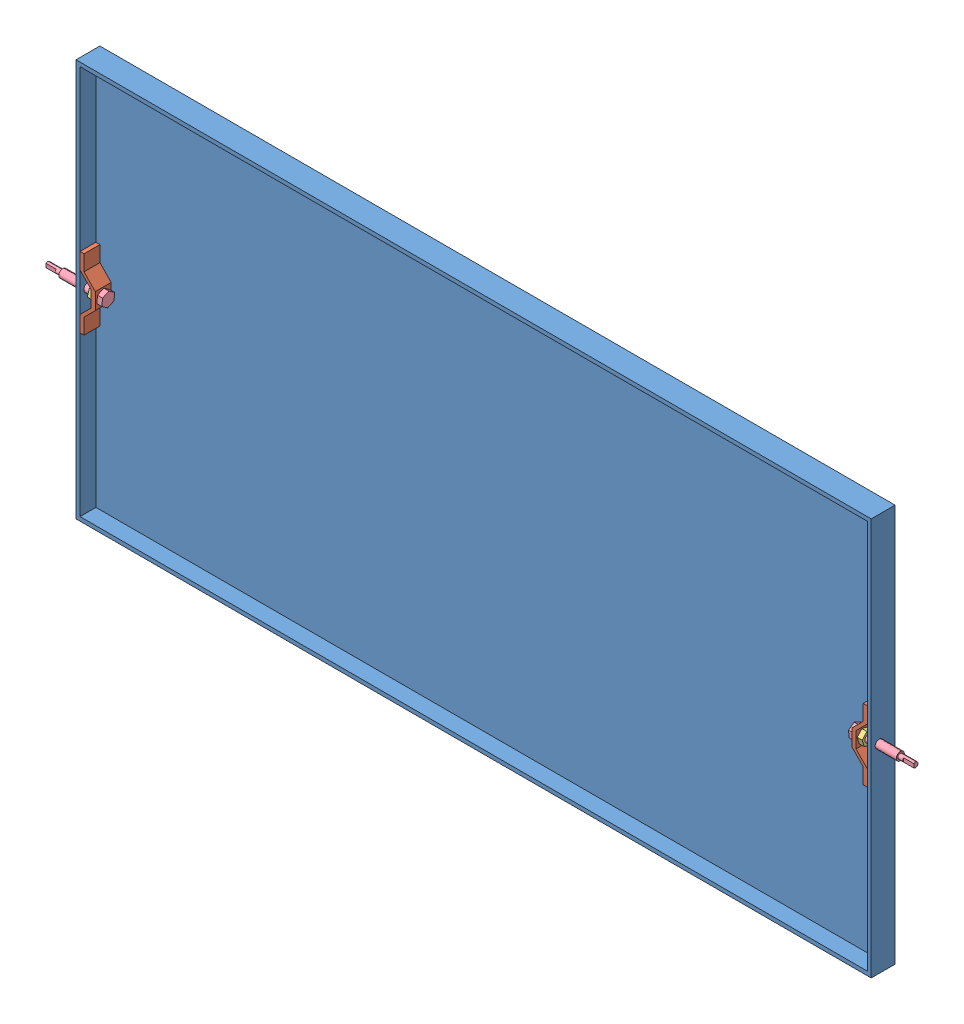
SolidWorks assembly NewPV.SLDASM, configuration Default (file format 6000). Lengths in mm.
Overall size (1091.28 500 30).
9 component instances, 4 part files, 7 mates.
Components (placement in the parent):
- PV-1: PV.SLDPRT [Default] at (433.7863 515.6704 734.8551) size (1000 500 30)
- Bracket4-1: Bracket4.SLDASM [Default] at (-102.3941 525.9347 668.1348) x (0 -1 0) z (0 0 1) size (88.65 76.21 20)
  - Bracket-1: Bracket.SLDPRT [Default] at (51.9842 89.971 66.7203) size (88.65 19.23 20)
  - nut3-1: nut3.SLDPRT [Default] at (11.0266 55.3171 76.7203) x (1 0.000622 0) z (0.000622 -1 0) size (16.83 17.15 6.35)
  - NewBolt2-1: NewBolt2.SLDPRT [Default] at (11.0235 60.394 76.7203) x (1 0.000622 -0.000622) z (0.000622 -1 0) size (17.53 15.96 76.2)
- Bracket4-2: Bracket4.SLDASM [Default] at (969.9667 504.5472 668.1348) x (0 1 0) z (0 0 1) size (88.65 76.21 20)
  - Bracket-1: Bracket.SLDPRT [Default] at (51.9842 89.971 66.7203) size (88.65 19.23 20)
  - nut3-1: nut3.SLDPRT [Default] at (11.0266 55.3171 76.7203) x (1 0.000622 0) z (0.000622 -1 0) size (16.83 17.15 6.35)
  - NewBolt2-1: NewBolt2.SLDPRT [Default] at (11.0235 60.394 76.7203) x (1 0.000622 -0.000622) z (0.000622 -1 0) size (17.53 15.96 76.2)
Mates (geometry in assembly coordinates):
- Concentric5: concentric aligned: cylinder of PV-1 through (-56.2137 515.6704 744.8551) axis (-1 0 0) radius 5.08; cylinder of ? through (-41.9968 515.6704 744.8551) axis (-1 0 0) radius 5.08
- Coincident9: coincident: plane of PV-1 through (433.7863 515.6704 754.8551) normal (0 0 1); plane of Bracket4-1/Bracket-1 through (-12.4231 473.9505 754.8551) normal (0 0 1)
- Concentric6: concentric aligned: cylinder of PV-1 through (923.7863 515.6704 744.8551) axis (1 0 0) radius 5.08; cylinder of ? through (909.5265 515.6704 744.8551) axis (1 0 0) radius 5.08
- Coincident10: coincident: plane of PV-1 through (433.7863 515.6704 754.8551) normal (0 0 1); plane of Bracket4-2/Bracket-1 through (863.3052 556.5618 754.8551) normal (0 0 1)
- Coincident11: coincident: plane of PV-1 through (433.7863 515.6704 754.8551) normal (0 0 1); plane of Bracket4-2/Bracket-1 through (863.3052 556.5618 754.8551) normal (0 0 1)
- Coincident12: coincident anti-aligned: plane of PV-1 through (-61.2137 760.6704 734.8551) normal (1 0 0); plane of Bracket4-1/Bracket-1 through (-61.2137 490.7765 754.8551) normal (-1 0 0)
- Coincident13: coincident anti-aligned: plane of PV-1 through (928.7863 760.6704 734.8551) normal (-1 0 0); plane of Bracket4-2/Bracket-1 through (928.7863 539.7054 754.8551) normal (1 0 0)
